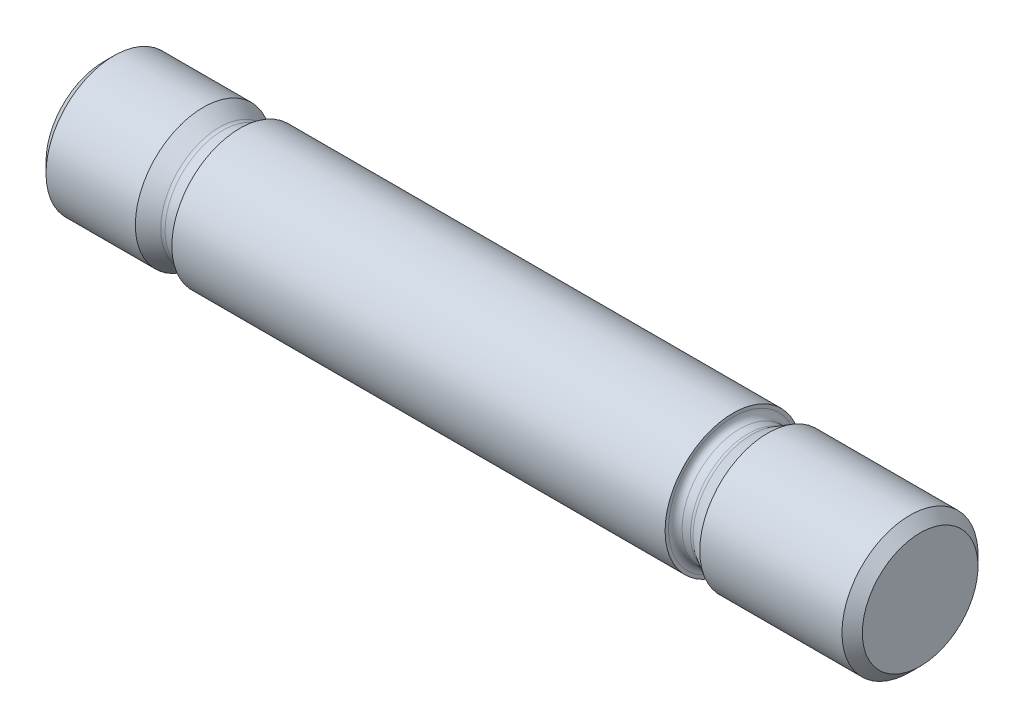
from build123d import *


with BuildPart() as part:
    # BodySke → BaseBody (revolve)
    with BuildSketch(Plane.XY, mode=Mode.PRIVATE) as basebody_sk:
        with BuildLine():
            Line((17, 8.633974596), (14.633974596, 10))
            Line((14.633974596, 10), (1.5, 10))
            Line((1.5, 10), (0, 8.5))
            Line((0, 8.5), (0, 0))
            Line((0, 0), (120, 0))
            Line((120, 0), (120, 8.5))
            Line((120, 8.5), (118.5, 10))
            Line((118.5, 10), (97.6, 10))
            Line((97.6, 10), (95.233974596, 8.633974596))
            ThreePointArc((95.233974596, 8.633974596), (94.992793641, 8.534074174), (94.733974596, 8.5))
            Line((94.733974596, 8.5), (93.501923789, 8.5))
            ThreePointArc((93.501923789, 8.5), (92.794817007, 8.792893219), (92.501923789, 9.5))
            Line((92.501923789, 9.5), (92.501923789, 10))
            Line((92.501923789, 10), (20, 10))
            Line((20, 10), (20, 9.5))
            ThreePointArc((20, 9.5), (19.707106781, 8.792893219), (19, 8.5))
            Line((19, 8.5), (17.5, 8.5))
            ThreePointArc((17.5, 8.5), (17.241180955, 8.534074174), (17, 8.633974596))
        make_face()
    revolve(basebody_sk.sketch.rotate(Axis((-3.175, 0, 0), (1, 0, 0)), 90), axis=Axis((-3.175, 0, 0), (1, 0, 0)))


solid = part.part
